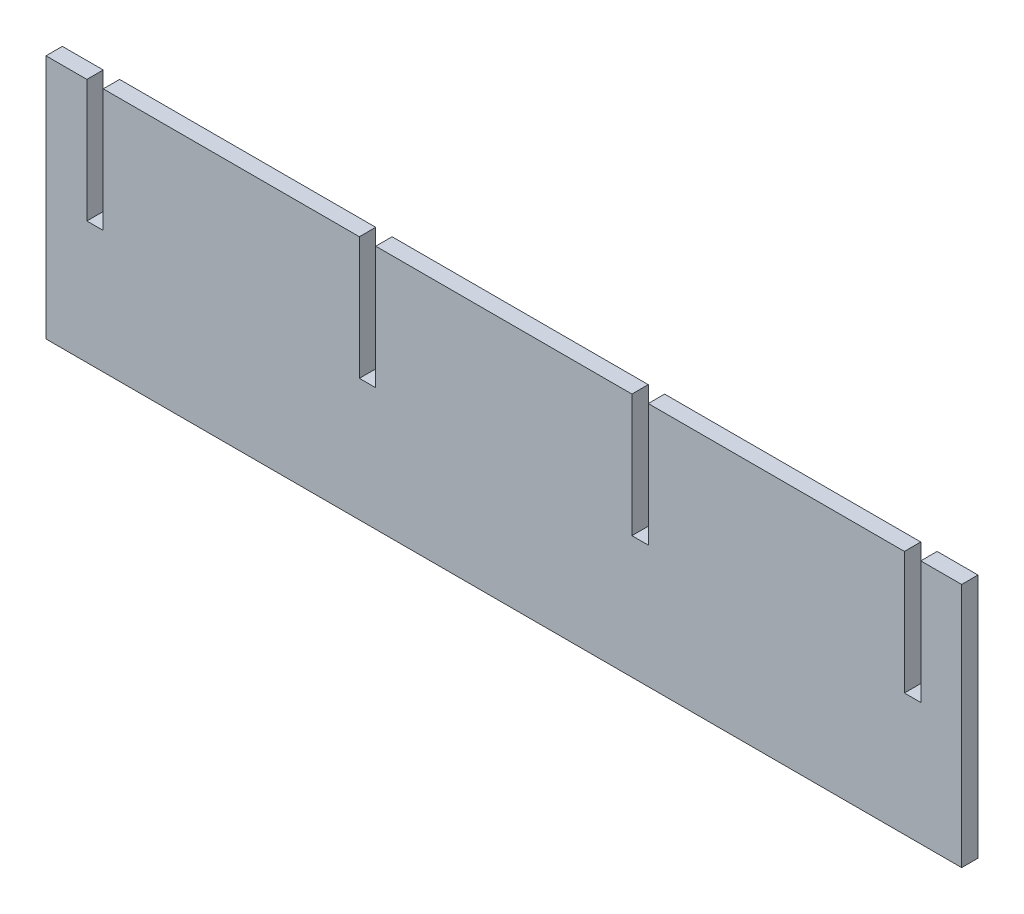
from build123d import *

# Parameters (mm, degrees)
BOSS_EXTRUDE1_DEPTH = 12


with BuildPart() as part:
    # Sketch3 → Boss-Extrude1 (new body)
    with BuildSketch(Plane(origin=(0, 0, 0), x_dir=(0, 1, 0), z_dir=(0, 0, 1))):
        Polygon((0, -94), (90, -94), (90, 94), (0, 94), (0, 106), (90, 106), (90, 294), (0, 294), (0, 306), (90, 306), (90, 336), (-90, 336), (-90, -336), (90, -336), (90, -306), (0, -306), (0, -294), (90, -294), (90, -106), (0, -106), align=None)
    extrude(amount=BOSS_EXTRUDE1_DEPTH)


solid = part.part
